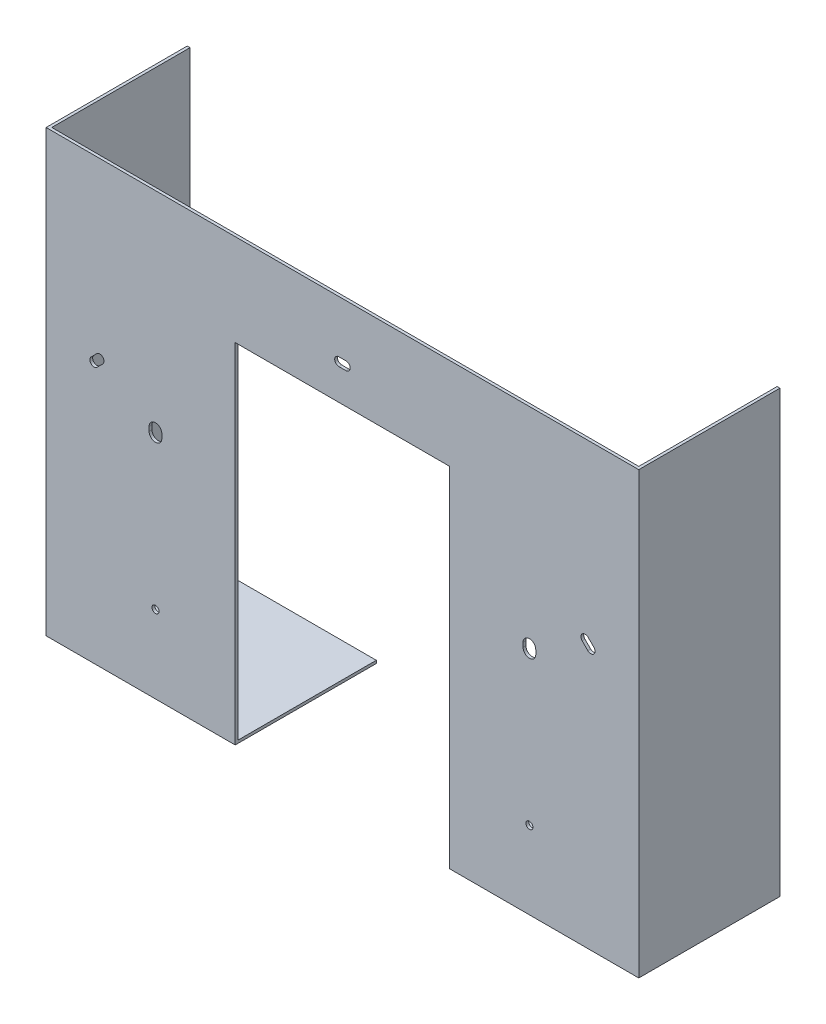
from build123d import *

# Parameters (mm, degrees)
ESQUISSE1_W             = 420
ESQUISSE1_H             = 312
EXTRUSION1_DEPTH        = 100
COQUE1_T                = -2
ESQUISSE2_W             = 152
ESQUISSE2_H             = 269.447188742
ENL_V_MAT_EXTRU_1_DEPTH = 533.676261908
ESQUISSE3_R             = 2.5
ENL_V_MAT_EXTRU_2_DEPTH = 100
ENL_V_MAT_EXTRU_3_DEPTH = 100
ENL_V_MAT_EXTRU_4_DEPTH = 100
ENL_V_MAT_EXTRU_5_DEPTH = 100
ENL_V_MAT_EXTRU_6_DEPTH = 100


with BuildPart() as part:
    # Esquisse1 → Extrusion1 (new body)
    with BuildSketch(Plane.XY):
        with Locations((210, 156)):
            Rectangle(ESQUISSE1_W, ESQUISSE1_H)
    extrude(amount=EXTRUSION1_DEPTH)

    # Coque1
    coque1_openings = [part.faces().sort_by_distance(p)[0] for p in [
        (210, 156, 0),
        (210, 312, 50),
    ]]
    offset(amount=COQUE1_T, openings=coque1_openings, kind=Kind.INTERSECTION)

    # Esquisse2 → Enl_v. mat.-Extru.1 (cut, through all)
    with BuildSketch(Plane.XY.offset(100)):
        with Locations((210, 112.276405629)):
            Rectangle(ESQUISSE2_W, ESQUISSE2_H)
    extrude(amount=-ENL_V_MAT_EXTRU_1_DEPTH, mode=Mode.SUBTRACT)

    # Esquisse3 → Enl_v. mat.-Extru.2 (cut)
    with BuildSketch(Plane.XY.offset(100)):
        with Locations((77.5, 55)):
            Circle(ESQUISSE3_R)
        with Locations((342.5, 55)):
            Circle(ESQUISSE3_R)
    extrude(amount=-ENL_V_MAT_EXTRU_2_DEPTH, mode=Mode.SUBTRACT)

    # Esquisse4 → Enl_v. mat.-Extru.3 (cut)
    with BuildSketch(Plane.XY.offset(100)):
        with BuildLine():
            Line((73, 165), (73, 162))
            ThreePointArc((73, 162), (77.5, 157.5), (82, 162))
            Line((82, 162), (82, 165))
            ThreePointArc((82, 165), (77.5, 169.5), (73, 165))
        make_face()
        with BuildLine():
            Line((347, 165), (347, 162))
            ThreePointArc((347, 162), (342.5, 157.5), (338, 162))
            Line((338, 162), (338, 165))
            ThreePointArc((338, 165), (342.5, 169.5), (347, 165))
        make_face()
    extrude(amount=-ENL_V_MAT_EXTRU_3_DEPTH, mode=Mode.SUBTRACT)

    # Esquisse5 → Enl_v. mat.-Extru.4 (cut)
    with BuildSketch(Plane.XY.offset(100)):
        with BuildLine():
            Line((207.5, 275), (212.5, 275))
            ThreePointArc((212.5, 275), (215.5, 272), (212.5, 269))
            Line((212.5, 269), (207.5, 269))
            ThreePointArc((207.5, 269), (204.5, 272), (207.5, 275))
        make_face()
    extrude(amount=-ENL_V_MAT_EXTRU_4_DEPTH, mode=Mode.SUBTRACT)

    # Esquisse6 → Enl_v. mat.-Extru.5 (cut)
    with BuildSketch(Plane.XY.offset(100)):
        with BuildLine():
            Line((31.878679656, 187.121320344), (35.878679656, 191.121320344))
            ThreePointArc((35.878679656, 191.121320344), (40.121320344, 191.121320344), (40.121320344, 186.878679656))
            Line((40.121320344, 186.878679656), (36.121320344, 182.878679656))
            ThreePointArc((36.121320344, 182.878679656), (31.878679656, 182.878679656), (31.878679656, 187.121320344))
        make_face()
        with BuildLine():
            Line((388.121320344, 187.121320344), (384.121320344, 191.121320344))
            ThreePointArc((384.121320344, 191.121320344), (379.878679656, 191.121320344), (379.878679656, 186.878679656))
            Line((379.878679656, 186.878679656), (383.878679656, 182.878679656))
            ThreePointArc((383.878679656, 182.878679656), (388.121320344, 182.878679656), (388.121320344, 187.121320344))
        make_face()
    extrude(amount=-ENL_V_MAT_EXTRU_5_DEPTH, mode=Mode.SUBTRACT)

    # Esquisse7 → Enl_v. mat.-Extru.6 (cut)
    with BuildSketch(Plane.XZ):
        with BuildLine():
            Line((91, 76), (91, 67))
            ThreePointArc((91, 67), (85, 61), (79, 67))
            Line((79, 67), (79, 76))
            ThreePointArc((79, 76), (85, 82), (91, 76))
        make_face()
        with BuildLine():
            Line((341, 76), (341, 67))
            ThreePointArc((341, 67), (335, 61), (329, 67))
            Line((329, 67), (329, 76))
            ThreePointArc((329, 76), (335, 82), (341, 76))
        make_face()
    extrude(amount=-ENL_V_MAT_EXTRU_6_DEPTH, mode=Mode.SUBTRACT)


solid = part.part
